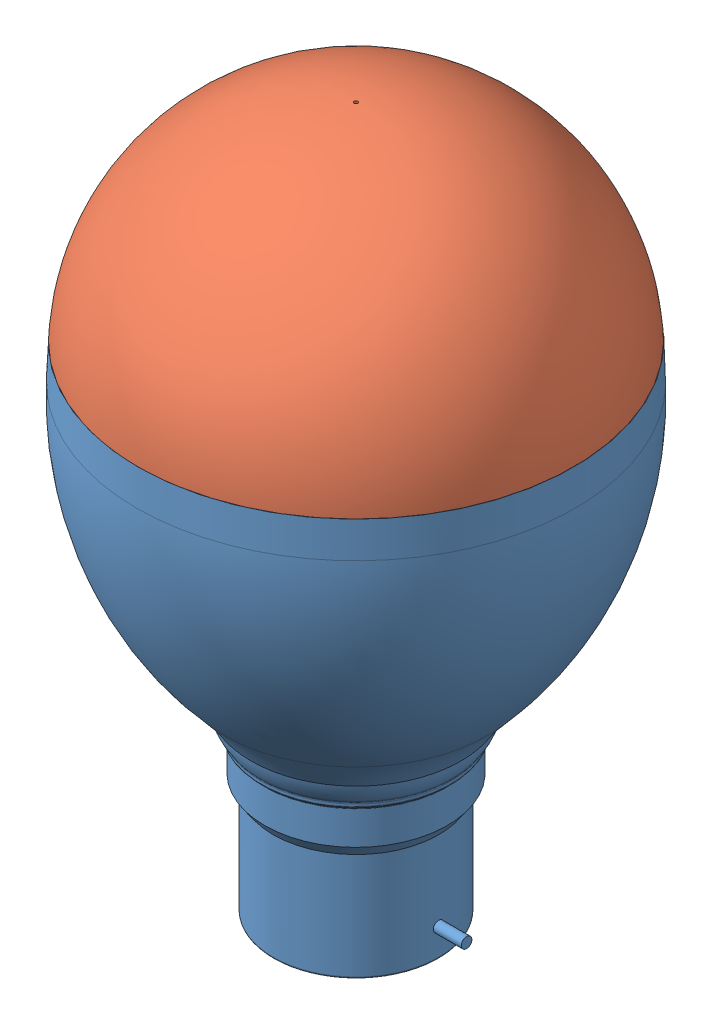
SolidWorks assembly LED Bulb Assembly.SLDASM, configuration Default (file format 13000). Lengths in mm.
Overall size (270.86 206.08 234.99).
3 component instances, 3 part files, 4 mates.
Components (placement in the parent):
- Led part 1-1: Led part 1.SLDPRT [Default] at (22.5882 32.8807 13.0291) size (270.86 165.15 234.99)
- Led part 2-1: Led part 2.SLDPRT [Default] at (22.5882 135.0017 13.0291) x (0.999381 0 0.035191) z (-0.035191 0 0.999381) size (123.85 59 123.85)
- PCB holder-1: PCB holder.SLDPRT [Default] at (22.5882 137.1712 13.0291) x (-0.703801 0 -0.710397) z (-0.710397 0 0.703801) size (120 7 120)
Mates (geometry in assembly coordinates):
- Concentric2: concentric aligned: circle of Led part 1-1; circle of Led part 2-1
- Coincident6: coincident anti-aligned: plane of Led part 1-1; plane of Led part 2-1 through (22.5882 138.0017 13.0291) normal (0 -1 0)
- Concentric3: concentric anti-aligned: circle of Led part 1-1; circle of PCB holder-1
- Coincident7: coincident anti-aligned: plane of Led part 1-1 through (22.5882 130.1712 13.0291) normal (0 1 0); plane of PCB holder-1 through (22.5882 130.1712 13.0291) normal (0 -1 0)
